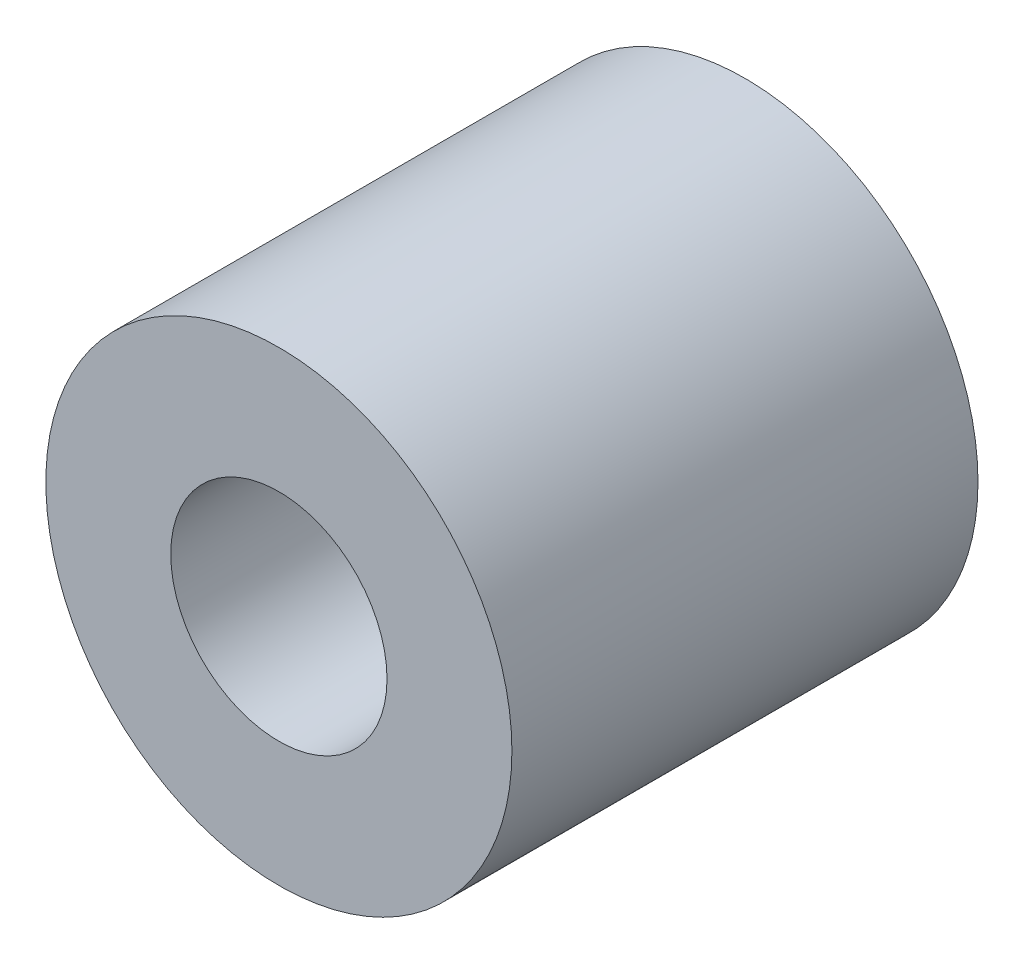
from build123d import *

# Parameters (mm, degrees)
SKETCH1_R             = 3.175
BOSS_EXTRUDE1_DEPTH   = 6.35
F_4_CLEARANCE_HOLE1_D = 2.9464


with BuildPart() as part:
    # Sketch1 → Boss-Extrude1 (new body)
    with BuildSketch(Plane.XY):
        Circle(SKETCH1_R)
    extrude(amount=BOSS_EXTRUDE1_DEPTH)

    # 4 Clearance Hole1 (through all)
    with Locations(Plane.XY.offset(6.35)):
        with Locations((0, 0)):
            Hole(F_4_CLEARANCE_HOLE1_D / 2)


solid = part.part
